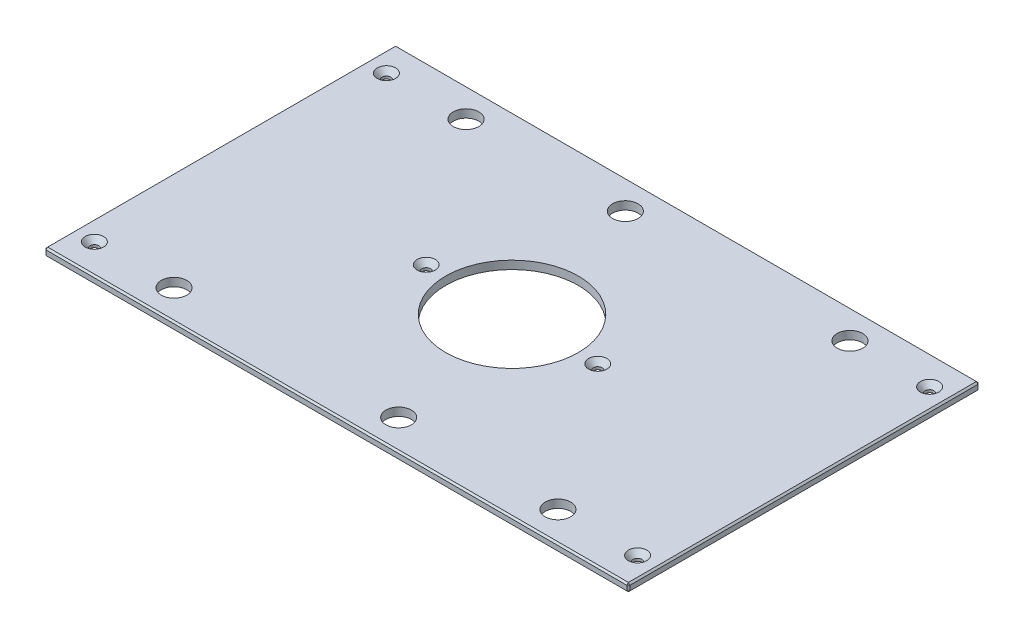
ISO-10303-21;
HEADER;
FILE_DESCRIPTION(('STEP AP214'),'2;1');
FILE_NAME('part.step','',(''),(''),'','','');
FILE_SCHEMA(('AUTOMOTIVE_DESIGN { 1 0 10303 214 1 1 1 1 }'));
ENDSEC;
DATA;
#1=APPLICATION_CONTEXT('core data for automotive mechanical design processes');
#2=APPLICATION_PROTOCOL_DEFINITION('international standard','automotive_design',2000,#1);
#3=PRODUCT_CONTEXT('',#1,'mechanical');
#4=PRODUCT('Part','Part','',(#3));
#5=PRODUCT_RELATED_PRODUCT_CATEGORY('part','',(#4));
#6=PRODUCT_DEFINITION_FORMATION('','',#4);
#7=PRODUCT_DEFINITION_CONTEXT('part definition',#1,'design');
#8=PRODUCT_DEFINITION('design','',#6,#7);
#9=PRODUCT_DEFINITION_SHAPE('','',#8);
#10=(LENGTH_UNIT() NAMED_UNIT(*) SI_UNIT(.MILLI.,.METRE.));
#11=(NAMED_UNIT(*) PLANE_ANGLE_UNIT() SI_UNIT($,.RADIAN.));
#12=(NAMED_UNIT(*) SI_UNIT($,.STERADIAN.) SOLID_ANGLE_UNIT());
#13=UNCERTAINTY_MEASURE_WITH_UNIT(LENGTH_MEASURE(1.E-05),#10,'distance_accuracy_value','');
#14=(GEOMETRIC_REPRESENTATION_CONTEXT(3) GLOBAL_UNCERTAINTY_ASSIGNED_CONTEXT((#13)) GLOBAL_UNIT_ASSIGNED_CONTEXT((#10,
#11,#12)) REPRESENTATION_CONTEXT('',''));
#15=CARTESIAN_POINT('',(0.,0.,0.));
#16=DIRECTION('',(0.,0.,1.));
#17=DIRECTION('',(1.,0.,0.));
#18=AXIS2_PLACEMENT_3D('',#15,#16,#17);
#19=CARTESIAN_POINT('',(-227.0125,6.35,-136.525));
#20=DIRECTION('',(1.,0.,0.));
#21=DIRECTION('',(0.,0.,-1.));
#22=AXIS2_PLACEMENT_3D('',#19,#20,#21);
#23=PLANE('',#22);
#24=DIRECTION('',(0.,0.,-1.));
#25=VECTOR('',#24,1.);
#26=CARTESIAN_POINT('',(-227.0125,5.08000000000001,-136.525));
#27=LINE('',#26,#25);
#28=CARTESIAN_POINT('',(-227.0125,5.08000000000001,135.255));
#29=VERTEX_POINT('',#28);
#30=CARTESIAN_POINT('',(-227.0125,5.08000000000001,-135.255));
#31=VERTEX_POINT('',#30);
#32=EDGE_CURVE('E134',#29,#31,#27,.T.);
#33=ORIENTED_EDGE('',*,*,#32,.T.);
#34=DIRECTION('',(0.,-1.,0.));
#35=VECTOR('',#34,1.);
#36=CARTESIAN_POINT('',(-227.0125,6.35,-135.255));
#37=LINE('',#36,#35);
#38=CARTESIAN_POINT('',(-227.0125,1.26999999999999,-135.255));
#39=VERTEX_POINT('',#38);
#40=EDGE_CURVE('E130',#31,#39,#37,.T.);
#41=ORIENTED_EDGE('',*,*,#40,.T.);
#42=DIRECTION('',(0.,0.,1.));
#43=VECTOR('',#42,1.);
#44=CARTESIAN_POINT('',(-227.0125,1.26999999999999,-136.525));
#45=LINE('',#44,#43);
#46=CARTESIAN_POINT('',(-227.0125,1.26999999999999,135.255));
#47=VERTEX_POINT('',#46);
#48=EDGE_CURVE('E125',#39,#47,#45,.T.);
#49=ORIENTED_EDGE('',*,*,#48,.T.);
#50=DIRECTION('',(0.,1.,0.));
#51=VECTOR('',#50,1.);
#52=CARTESIAN_POINT('',(-227.0125,6.35,135.255));
#53=LINE('',#52,#51);
#54=EDGE_CURVE('E127',#47,#29,#53,.T.);
#55=ORIENTED_EDGE('',*,*,#54,.T.);
#56=EDGE_LOOP('',(#33,#41,#49,#55));
#57=FACE_BOUND('',#56,.T.);
#58=ADVANCED_FACE('F34',(#57),#23,.F.);
#59=CARTESIAN_POINT('',(-227.0125,6.35,136.525));
#60=DIRECTION('',(0.,0.,-1.));
#61=DIRECTION('',(-1.,0.,0.));
#62=AXIS2_PLACEMENT_3D('',#59,#60,#61);
#63=PLANE('',#62);
#64=DIRECTION('',(1.,0.,0.));
#65=VECTOR('',#64,1.);
#66=CARTESIAN_POINT('',(-227.0125,1.26999999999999,136.525));
#67=LINE('',#66,#65);
#68=CARTESIAN_POINT('',(-225.7425,1.26999999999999,136.525));
#69=VERTEX_POINT('',#68);
#70=CARTESIAN_POINT('',(225.7425,1.26999999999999,136.525));
#71=VERTEX_POINT('',#70);
#72=EDGE_CURVE('E57',#69,#71,#67,.T.);
#73=ORIENTED_EDGE('',*,*,#72,.T.);
#74=DIRECTION('',(0.,1.,0.));
#75=VECTOR('',#74,1.);
#76=CARTESIAN_POINT('',(225.7425,6.35,136.525));
#77=LINE('',#76,#75);
#78=CARTESIAN_POINT('',(225.7425,5.08000000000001,136.525));
#79=VERTEX_POINT('',#78);
#80=EDGE_CURVE('E11',#71,#79,#77,.T.);
#81=ORIENTED_EDGE('',*,*,#80,.T.);
#82=DIRECTION('',(-1.,0.,0.));
#83=VECTOR('',#82,1.);
#84=CARTESIAN_POINT('',(-227.0125,5.08000000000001,136.525));
#85=LINE('',#84,#83);
#86=CARTESIAN_POINT('',(-225.7425,5.08000000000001,136.525));
#87=VERTEX_POINT('',#86);
#88=EDGE_CURVE('E43',#79,#87,#85,.T.);
#89=ORIENTED_EDGE('',*,*,#88,.T.);
#90=DIRECTION('',(0.,-1.,0.));
#91=VECTOR('',#90,1.);
#92=CARTESIAN_POINT('',(-225.7425,6.35,136.525));
#93=LINE('',#92,#91);
#94=EDGE_CURVE('E290',#87,#69,#93,.T.);
#95=ORIENTED_EDGE('',*,*,#94,.T.);
#96=EDGE_LOOP('',(#73,#81,#89,#95));
#97=FACE_BOUND('',#96,.T.);
#98=ADVANCED_FACE('F359',(#97),#63,.F.);
#99=CARTESIAN_POINT('',(227.0125,6.35,-136.525));
#100=DIRECTION('',(-1.,0.,0.));
#101=DIRECTION('',(0.,0.,1.));
#102=AXIS2_PLACEMENT_3D('',#99,#100,#101);
#103=PLANE('',#102);
#104=DIRECTION('',(0.,0.,-1.));
#105=VECTOR('',#104,1.);
#106=CARTESIAN_POINT('',(227.0125,1.26999999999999,-136.525));
#107=LINE('',#106,#105);
#108=CARTESIAN_POINT('',(227.0125,1.26999999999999,135.255));
#109=VERTEX_POINT('',#108);
#110=CARTESIAN_POINT('',(227.0125,1.26999999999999,-135.255));
#111=VERTEX_POINT('',#110);
#112=EDGE_CURVE('E285',#109,#111,#107,.T.);
#113=ORIENTED_EDGE('',*,*,#112,.T.);
#114=DIRECTION('',(0.,1.,0.));
#115=VECTOR('',#114,1.);
#116=CARTESIAN_POINT('',(227.0125,6.35,-135.255));
#117=LINE('',#116,#115);
#118=CARTESIAN_POINT('',(227.0125,5.08000000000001,-135.255));
#119=VERTEX_POINT('',#118);
#120=EDGE_CURVE('E287',#111,#119,#117,.T.);
#121=ORIENTED_EDGE('',*,*,#120,.T.);
#122=DIRECTION('',(0.,0.,1.));
#123=VECTOR('',#122,1.);
#124=CARTESIAN_POINT('',(227.0125,5.08000000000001,136.525));
#125=LINE('',#124,#123);
#126=CARTESIAN_POINT('',(227.0125,5.08000000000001,135.255));
#127=VERTEX_POINT('',#126);
#128=EDGE_CURVE('E283',#119,#127,#125,.T.);
#129=ORIENTED_EDGE('',*,*,#128,.T.);
#130=DIRECTION('',(0.,-1.,0.));
#131=VECTOR('',#130,1.);
#132=CARTESIAN_POINT('',(227.0125,6.35,135.255));
#133=LINE('',#132,#131);
#134=EDGE_CURVE('E281',#127,#109,#133,.T.);
#135=ORIENTED_EDGE('',*,*,#134,.T.);
#136=EDGE_LOOP('',(#113,#121,#129,#135));
#137=FACE_BOUND('',#136,.T.);
#138=ADVANCED_FACE('F346',(#137),#103,.F.);
#139=CARTESIAN_POINT('',(-227.0125,6.35,-136.525));
#140=DIRECTION('',(0.,0.,1.));
#141=DIRECTION('',(1.,0.,0.));
#142=AXIS2_PLACEMENT_3D('',#139,#140,#141);
#143=PLANE('',#142);
#144=DIRECTION('',(-1.,0.,0.));
#145=VECTOR('',#144,1.);
#146=CARTESIAN_POINT('',(-227.0125,1.26999999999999,-136.525));
#147=LINE('',#146,#145);
#148=CARTESIAN_POINT('',(225.7425,1.26999999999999,-136.525));
#149=VERTEX_POINT('',#148);
#150=CARTESIAN_POINT('',(-225.7425,1.26999999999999,-136.525));
#151=VERTEX_POINT('',#150);
#152=EDGE_CURVE('E257',#149,#151,#147,.T.);
#153=ORIENTED_EDGE('',*,*,#152,.T.);
#154=DIRECTION('',(0.,1.,0.));
#155=VECTOR('',#154,1.);
#156=CARTESIAN_POINT('',(-225.7425,6.35,-136.525));
#157=LINE('',#156,#155);
#158=CARTESIAN_POINT('',(-225.7425,5.08000000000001,-136.525));
#159=VERTEX_POINT('',#158);
#160=EDGE_CURVE('E261',#151,#159,#157,.T.);
#161=ORIENTED_EDGE('',*,*,#160,.T.);
#162=DIRECTION('',(1.,0.,0.));
#163=VECTOR('',#162,1.);
#164=CARTESIAN_POINT('',(227.0125,5.08000000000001,-136.525));
#165=LINE('',#164,#163);
#166=CARTESIAN_POINT('',(225.7425,5.08000000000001,-136.525));
#167=VERTEX_POINT('',#166);
#168=EDGE_CURVE('E259',#159,#167,#165,.T.);
#169=ORIENTED_EDGE('',*,*,#168,.T.);
#170=DIRECTION('',(0.,-1.,0.));
#171=VECTOR('',#170,1.);
#172=CARTESIAN_POINT('',(225.7425,6.35,-136.525));
#173=LINE('',#172,#171);
#174=EDGE_CURVE('E255',#167,#149,#173,.T.);
#175=ORIENTED_EDGE('',*,*,#174,.T.);
#176=EDGE_LOOP('',(#153,#161,#169,#175));
#177=FACE_BOUND('',#176,.T.);
#178=ADVANCED_FACE('F320',(#177),#143,.F.);
#179=CARTESIAN_POINT('',(0.,6.35,0.));
#180=DIRECTION('',(0.,1.,0.));
#181=DIRECTION('',(0.,0.,1.));
#182=AXIS2_PLACEMENT_3D('',#179,#180,#181);
#183=PLANE('',#182);
#184=CARTESIAN_POINT('',(211.1375,6.35,-113.50498));
#185=DIRECTION('',(0.,1.,0.));
#186=DIRECTION('',(0.,0.,1.));
#187=AXIS2_PLACEMENT_3D('',#184,#185,#186);
#188=CIRCLE('',#187,7.13739999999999);
#189=CARTESIAN_POINT('',(211.1375,6.35,-106.36758));
#190=VERTEX_POINT('',#189);
#191=EDGE_CURVE('E783',#190,#190,#188,.T.);
#192=ORIENTED_EDGE('',*,*,#191,.F.);
#193=EDGE_LOOP('',(#192));
#194=FACE_BOUND('',#193,.T.);
#195=CARTESIAN_POINT('',(211.1375,6.35,113.50498));
#196=DIRECTION('',(0.,1.,0.));
#197=DIRECTION('',(0.,0.,1.));
#198=AXIS2_PLACEMENT_3D('',#195,#196,#197);
#199=CIRCLE('',#198,7.13739999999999);
#200=CARTESIAN_POINT('',(211.1375,6.35,120.64238));
#201=VERTEX_POINT('',#200);
#202=EDGE_CURVE('E787',#201,#201,#199,.T.);
#203=ORIENTED_EDGE('',*,*,#202,.F.);
#204=EDGE_LOOP('',(#203));
#205=FACE_BOUND('',#204,.T.);
#206=CARTESIAN_POINT('',(-211.1375,6.35,113.50498));
#207=DIRECTION('',(0.,1.,0.));
#208=DIRECTION('',(0.,0.,1.));
#209=AXIS2_PLACEMENT_3D('',#206,#207,#208);
#210=CIRCLE('',#209,7.13739999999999);
#211=CARTESIAN_POINT('',(-211.1375,6.35,120.64238));
#212=VERTEX_POINT('',#211);
#213=EDGE_CURVE('E791',#212,#212,#210,.T.);
#214=ORIENTED_EDGE('',*,*,#213,.F.);
#215=EDGE_LOOP('',(#214));
#216=FACE_BOUND('',#215,.T.);
#217=CARTESIAN_POINT('',(-66.675,6.35,0.));
#218=DIRECTION('',(0.,1.,0.));
#219=DIRECTION('',(0.,0.,1.));
#220=AXIS2_PLACEMENT_3D('',#217,#218,#219);
#221=CIRCLE('',#220,7.1374);
#222=CARTESIAN_POINT('',(-66.675,6.35,7.1374));
#223=VERTEX_POINT('',#222);
#224=EDGE_CURVE('E795',#223,#223,#221,.T.);
#225=ORIENTED_EDGE('',*,*,#224,.F.);
#226=EDGE_LOOP('',(#225));
#227=FACE_BOUND('',#226,.T.);
#228=CARTESIAN_POINT('',(66.675,6.35,0.));
#229=DIRECTION('',(0.,1.,0.));
#230=DIRECTION('',(0.,0.,1.));
#231=AXIS2_PLACEMENT_3D('',#228,#229,#230);
#232=CIRCLE('',#231,7.1374);
#233=CARTESIAN_POINT('',(66.675,6.35,7.1374));
#234=VERTEX_POINT('',#233);
#235=EDGE_CURVE('E799',#234,#234,#232,.T.);
#236=ORIENTED_EDGE('',*,*,#235,.F.);
#237=EDGE_LOOP('',(#236));
#238=FACE_BOUND('',#237,.T.);
#239=CARTESIAN_POINT('',(-211.1375,6.35,-113.50498));
#240=DIRECTION('',(0.,1.,0.));
#241=DIRECTION('',(0.,0.,1.));
#242=AXIS2_PLACEMENT_3D('',#239,#240,#241);
#243=CIRCLE('',#242,7.13739999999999);
#244=CARTESIAN_POINT('',(-211.1375,6.35,-106.36758));
#245=VERTEX_POINT('',#244);
#246=EDGE_CURVE('E802',#245,#245,#243,.T.);
#247=ORIENTED_EDGE('',*,*,#246,.F.);
#248=EDGE_LOOP('',(#247));
#249=FACE_BOUND('',#248,.T.);
#250=DIRECTION('',(0.,0.,-1.));
#251=VECTOR('',#250,1.);
#252=CARTESIAN_POINT('',(225.7425,6.35,-136.525));
#253=LINE('',#252,#251);
#254=CARTESIAN_POINT('',(225.7425,6.35,135.255));
#255=VERTEX_POINT('',#254);
#256=CARTESIAN_POINT('',(225.7425,6.35,-135.255));
#257=VERTEX_POINT('',#256);
#258=EDGE_CURVE('E268',#255,#257,#253,.T.);
#259=ORIENTED_EDGE('',*,*,#258,.T.);
#260=DIRECTION('',(-1.,0.,0.));
#261=VECTOR('',#260,1.);
#262=CARTESIAN_POINT('',(-227.0125,6.35,-135.255));
#263=LINE('',#262,#261);
#264=CARTESIAN_POINT('',(-225.7425,6.35,-135.255));
#265=VERTEX_POINT('',#264);
#266=EDGE_CURVE('E270',#257,#265,#263,.T.);
#267=ORIENTED_EDGE('',*,*,#266,.T.);
#268=DIRECTION('',(0.,0.,1.));
#269=VECTOR('',#268,1.);
#270=CARTESIAN_POINT('',(-225.7425,6.35,136.525));
#271=LINE('',#270,#269);
#272=CARTESIAN_POINT('',(-225.7425,6.35,135.255));
#273=VERTEX_POINT('',#272);
#274=EDGE_CURVE('E266',#265,#273,#271,.T.);
#275=ORIENTED_EDGE('',*,*,#274,.T.);
#276=DIRECTION('',(1.,0.,0.));
#277=VECTOR('',#276,1.);
#278=CARTESIAN_POINT('',(227.0125,6.35,135.255));
#279=LINE('',#278,#277);
#280=EDGE_CURVE('E264',#273,#255,#279,.T.);
#281=ORIENTED_EDGE('',*,*,#280,.T.);
#282=EDGE_LOOP('',(#259,#267,#275,#281));
#283=FACE_BOUND('',#282,.T.);
#284=CARTESIAN_POINT('',(149.225,6.35,-113.50498));
#285=DIRECTION('',(0.,1.,0.));
#286=DIRECTION('',(0.,0.,1.));
#287=AXIS2_PLACEMENT_3D('',#284,#285,#286);
#288=CIRCLE('',#287,9.921875);
#289=CARTESIAN_POINT('',(149.225,6.35,-103.583105));
#290=VERTEX_POINT('',#289);
#291=EDGE_CURVE('E203',#290,#290,#288,.T.);
#292=ORIENTED_EDGE('',*,*,#291,.F.);
#293=EDGE_LOOP('',(#292));
#294=FACE_BOUND('',#293,.T.);
#295=CARTESIAN_POINT('',(-149.225,6.35,-113.50498));
#296=DIRECTION('',(0.,1.,0.));
#297=DIRECTION('',(0.,0.,1.));
#298=AXIS2_PLACEMENT_3D('',#295,#296,#297);
#299=CIRCLE('',#298,9.921875);
#300=CARTESIAN_POINT('',(-149.225,6.35,-103.583105));
#301=VERTEX_POINT('',#300);
#302=EDGE_CURVE('E213',#301,#301,#299,.T.);
#303=ORIENTED_EDGE('',*,*,#302,.F.);
#304=EDGE_LOOP('',(#303));
#305=FACE_BOUND('',#304,.T.);
#306=CARTESIAN_POINT('',(149.225,6.35,113.50498));
#307=DIRECTION('',(0.,1.,0.));
#308=DIRECTION('',(0.,0.,1.));
#309=AXIS2_PLACEMENT_3D('',#306,#307,#308);
#310=CIRCLE('',#309,9.921875);
#311=CARTESIAN_POINT('',(149.225,6.35,123.426855));
#312=VERTEX_POINT('',#311);
#313=EDGE_CURVE('E224',#312,#312,#310,.T.);
#314=ORIENTED_EDGE('',*,*,#313,.F.);
#315=EDGE_LOOP('',(#314));
#316=FACE_BOUND('',#315,.T.);
#317=CARTESIAN_POINT('',(-149.225,6.35,113.50498));
#318=DIRECTION('',(0.,1.,0.));
#319=DIRECTION('',(0.,0.,1.));
#320=AXIS2_PLACEMENT_3D('',#317,#318,#319);
#321=CIRCLE('',#320,9.921875);
#322=CARTESIAN_POINT('',(-149.225,6.35,123.426855));
#323=VERTEX_POINT('',#322);
#324=EDGE_CURVE('E230',#323,#323,#321,.T.);
#325=ORIENTED_EDGE('',*,*,#324,.F.);
#326=EDGE_LOOP('',(#325));
#327=FACE_BOUND('',#326,.T.);
#328=CARTESIAN_POINT('',(-25.4,6.35,-113.50498));
#329=DIRECTION('',(0.,1.,0.));
#330=DIRECTION('',(0.,0.,1.));
#331=AXIS2_PLACEMENT_3D('',#328,#329,#330);
#332=CIRCLE('',#331,9.921875);
#333=CARTESIAN_POINT('',(-25.4,6.35,-103.583105));
#334=VERTEX_POINT('',#333);
#335=EDGE_CURVE('E236',#334,#334,#332,.T.);
#336=ORIENTED_EDGE('',*,*,#335,.F.);
#337=EDGE_LOOP('',(#336));
#338=FACE_BOUND('',#337,.T.);
#339=CARTESIAN_POINT('',(25.4,6.35,113.50498));
#340=DIRECTION('',(0.,1.,0.));
#341=DIRECTION('',(0.,0.,1.));
#342=AXIS2_PLACEMENT_3D('',#339,#340,#341);
#343=CIRCLE('',#342,9.921875);
#344=CARTESIAN_POINT('',(25.4,6.35,123.426855));
#345=VERTEX_POINT('',#344);
#346=EDGE_CURVE('E242',#345,#345,#343,.T.);
#347=ORIENTED_EDGE('',*,*,#346,.F.);
#348=EDGE_LOOP('',(#347));
#349=FACE_BOUND('',#348,.T.);
#350=CARTESIAN_POINT('',(0.,6.35,0.));
#351=DIRECTION('',(0.,1.,0.));
#352=DIRECTION('',(0.,0.,1.));
#353=AXIS2_PLACEMENT_3D('',#350,#351,#352);
#354=CIRCLE('',#353,51.562);
#355=CARTESIAN_POINT('',(0.,6.35,51.562));
#356=VERTEX_POINT('',#355);
#357=EDGE_CURVE('E248',#356,#356,#354,.T.);
#358=ORIENTED_EDGE('',*,*,#357,.F.);
#359=EDGE_LOOP('',(#358));
#360=FACE_BOUND('',#359,.T.);
#361=ADVANCED_FACE('F368',(#194,#205,#216,#227,#238,#249,#283,#294,#305,#316,#327,#338,#349,
#360),#183,.T.);
#362=CARTESIAN_POINT('',(0.,0.,0.));
#363=DIRECTION('',(0.,1.,0.));
#364=DIRECTION('',(0.,0.,1.));
#365=AXIS2_PLACEMENT_3D('',#362,#363,#364);
#366=PLANE('',#365);
#367=CARTESIAN_POINT('',(211.1375,0.,-113.50498));
#368=DIRECTION('',(0.,1.,0.));
#369=DIRECTION('',(0.,0.,1.));
#370=AXIS2_PLACEMENT_3D('',#367,#368,#369);
#371=CIRCLE('',#370,3.3782);
#372=CARTESIAN_POINT('',(211.1375,0.,-110.12678));
#373=VERTEX_POINT('',#372);
#374=EDGE_CURVE('E836',#373,#373,#371,.T.);
#375=ORIENTED_EDGE('',*,*,#374,.T.);
#376=EDGE_LOOP('',(#375));
#377=FACE_BOUND('',#376,.T.);
#378=CARTESIAN_POINT('',(211.1375,0.,113.50498));
#379=DIRECTION('',(0.,1.,0.));
#380=DIRECTION('',(0.,0.,1.));
#381=AXIS2_PLACEMENT_3D('',#378,#379,#380);
#382=CIRCLE('',#381,3.3782);
#383=CARTESIAN_POINT('',(211.1375,0.,116.88318));
#384=VERTEX_POINT('',#383);
#385=EDGE_CURVE('E829',#384,#384,#382,.T.);
#386=ORIENTED_EDGE('',*,*,#385,.T.);
#387=EDGE_LOOP('',(#386));
#388=FACE_BOUND('',#387,.T.);
#389=CARTESIAN_POINT('',(-211.1375,0.,113.50498));
#390=DIRECTION('',(0.,1.,0.));
#391=DIRECTION('',(0.,0.,1.));
#392=AXIS2_PLACEMENT_3D('',#389,#390,#391);
#393=CIRCLE('',#392,3.3782);
#394=CARTESIAN_POINT('',(-211.1375,0.,116.88318));
#395=VERTEX_POINT('',#394);
#396=EDGE_CURVE('E822',#395,#395,#393,.T.);
#397=ORIENTED_EDGE('',*,*,#396,.T.);
#398=EDGE_LOOP('',(#397));
#399=FACE_BOUND('',#398,.T.);
#400=CARTESIAN_POINT('',(-66.675,0.,0.));
#401=DIRECTION('',(0.,1.,0.));
#402=DIRECTION('',(0.,0.,1.));
#403=AXIS2_PLACEMENT_3D('',#400,#401,#402);
#404=CIRCLE('',#403,3.3782);
#405=CARTESIAN_POINT('',(-66.675,0.,3.3782));
#406=VERTEX_POINT('',#405);
#407=EDGE_CURVE('E815',#406,#406,#404,.T.);
#408=ORIENTED_EDGE('',*,*,#407,.T.);
#409=EDGE_LOOP('',(#408));
#410=FACE_BOUND('',#409,.T.);
#411=CARTESIAN_POINT('',(66.675,0.,0.));
#412=DIRECTION('',(0.,1.,0.));
#413=DIRECTION('',(0.,0.,1.));
#414=AXIS2_PLACEMENT_3D('',#411,#412,#413);
#415=CIRCLE('',#414,3.3782);
#416=CARTESIAN_POINT('',(66.675,0.,3.3782));
#417=VERTEX_POINT('',#416);
#418=EDGE_CURVE('E805',#417,#417,#415,.T.);
#419=ORIENTED_EDGE('',*,*,#418,.T.);
#420=EDGE_LOOP('',(#419));
#421=FACE_BOUND('',#420,.T.);
#422=CARTESIAN_POINT('',(-211.1375,0.,-113.50498));
#423=DIRECTION('',(0.,1.,0.));
#424=DIRECTION('',(0.,0.,1.));
#425=AXIS2_PLACEMENT_3D('',#422,#423,#424);
#426=CIRCLE('',#425,3.3782);
#427=CARTESIAN_POINT('',(-211.1375,0.,-110.12678));
#428=VERTEX_POINT('',#427);
#429=EDGE_CURVE('E216',#428,#428,#426,.T.);
#430=ORIENTED_EDGE('',*,*,#429,.T.);
#431=EDGE_LOOP('',(#430));
#432=FACE_BOUND('',#431,.T.);
#433=DIRECTION('',(0.,0.,-1.));
#434=VECTOR('',#433,1.);
#435=CARTESIAN_POINT('',(-225.7425,0.,0.));
#436=LINE('',#435,#434);
#437=CARTESIAN_POINT('',(-225.7425,0.,135.255));
#438=VERTEX_POINT('',#437);
#439=CARTESIAN_POINT('',(-225.7425,0.,-135.255));
#440=VERTEX_POINT('',#439);
#441=EDGE_CURVE('E157',#438,#440,#436,.T.);
#442=ORIENTED_EDGE('',*,*,#441,.T.);
#443=DIRECTION('',(1.,0.,0.));
#444=VECTOR('',#443,1.);
#445=CARTESIAN_POINT('',(0.,0.,-135.255));
#446=LINE('',#445,#444);
#447=CARTESIAN_POINT('',(225.7425,0.,-135.255));
#448=VERTEX_POINT('',#447);
#449=EDGE_CURVE('E278',#440,#448,#446,.T.);
#450=ORIENTED_EDGE('',*,*,#449,.T.);
#451=DIRECTION('',(0.,0.,1.));
#452=VECTOR('',#451,1.);
#453=CARTESIAN_POINT('',(225.7425,0.,0.));
#454=LINE('',#453,#452);
#455=CARTESIAN_POINT('',(225.7425,0.,135.255));
#456=VERTEX_POINT('',#455);
#457=EDGE_CURVE('E276',#448,#456,#454,.T.);
#458=ORIENTED_EDGE('',*,*,#457,.T.);
#459=DIRECTION('',(-1.,0.,0.));
#460=VECTOR('',#459,1.);
#461=CARTESIAN_POINT('',(0.,0.,135.255));
#462=LINE('',#461,#460);
#463=EDGE_CURVE('E273',#456,#438,#462,.T.);
#464=ORIENTED_EDGE('',*,*,#463,.T.);
#465=EDGE_LOOP('',(#442,#450,#458,#464));
#466=FACE_BOUND('',#465,.T.);
#467=CARTESIAN_POINT('',(149.225,0.,-113.50498));
#468=DIRECTION('',(0.,1.,0.));
#469=DIRECTION('',(0.,0.,1.));
#470=AXIS2_PLACEMENT_3D('',#467,#468,#469);
#471=CIRCLE('',#470,9.921875);
#472=CARTESIAN_POINT('',(149.225,0.,-103.583105));
#473=VERTEX_POINT('',#472);
#474=EDGE_CURVE('E208',#473,#473,#471,.T.);
#475=ORIENTED_EDGE('',*,*,#474,.T.);
#476=EDGE_LOOP('',(#475));
#477=FACE_BOUND('',#476,.T.);
#478=CARTESIAN_POINT('',(-149.225,0.,-113.50498));
#479=DIRECTION('',(0.,1.,0.));
#480=DIRECTION('',(0.,0.,1.));
#481=AXIS2_PLACEMENT_3D('',#478,#479,#480);
#482=CIRCLE('',#481,9.921875);
#483=CARTESIAN_POINT('',(-149.225,0.,-103.583105));
#484=VERTEX_POINT('',#483);
#485=EDGE_CURVE('E221',#484,#484,#482,.T.);
#486=ORIENTED_EDGE('',*,*,#485,.T.);
#487=EDGE_LOOP('',(#486));
#488=FACE_BOUND('',#487,.T.);
#489=CARTESIAN_POINT('',(149.225,0.,113.50498));
#490=DIRECTION('',(0.,1.,0.));
#491=DIRECTION('',(0.,0.,1.));
#492=AXIS2_PLACEMENT_3D('',#489,#490,#491);
#493=CIRCLE('',#492,9.921875);
#494=CARTESIAN_POINT('',(149.225,0.,123.426855));
#495=VERTEX_POINT('',#494);
#496=EDGE_CURVE('E227',#495,#495,#493,.T.);
#497=ORIENTED_EDGE('',*,*,#496,.T.);
#498=EDGE_LOOP('',(#497));
#499=FACE_BOUND('',#498,.T.);
#500=CARTESIAN_POINT('',(-149.225,0.,113.50498));
#501=DIRECTION('',(0.,1.,0.));
#502=DIRECTION('',(0.,0.,1.));
#503=AXIS2_PLACEMENT_3D('',#500,#501,#502);
#504=CIRCLE('',#503,9.921875);
#505=CARTESIAN_POINT('',(-149.225,0.,123.426855));
#506=VERTEX_POINT('',#505);
#507=EDGE_CURVE('E233',#506,#506,#504,.T.);
#508=ORIENTED_EDGE('',*,*,#507,.T.);
#509=EDGE_LOOP('',(#508));
#510=FACE_BOUND('',#509,.T.);
#511=CARTESIAN_POINT('',(-25.4,0.,-113.50498));
#512=DIRECTION('',(0.,1.,0.));
#513=DIRECTION('',(0.,0.,1.));
#514=AXIS2_PLACEMENT_3D('',#511,#512,#513);
#515=CIRCLE('',#514,9.921875);
#516=CARTESIAN_POINT('',(-25.4,0.,-103.583105));
#517=VERTEX_POINT('',#516);
#518=EDGE_CURVE('E239',#517,#517,#515,.T.);
#519=ORIENTED_EDGE('',*,*,#518,.T.);
#520=EDGE_LOOP('',(#519));
#521=FACE_BOUND('',#520,.T.);
#522=CARTESIAN_POINT('',(25.4,0.,113.50498));
#523=DIRECTION('',(0.,1.,0.));
#524=DIRECTION('',(0.,0.,1.));
#525=AXIS2_PLACEMENT_3D('',#522,#523,#524);
#526=CIRCLE('',#525,9.921875);
#527=CARTESIAN_POINT('',(25.4,0.,123.426855));
#528=VERTEX_POINT('',#527);
#529=EDGE_CURVE('E245',#528,#528,#526,.T.);
#530=ORIENTED_EDGE('',*,*,#529,.T.);
#531=EDGE_LOOP('',(#530));
#532=FACE_BOUND('',#531,.T.);
#533=CARTESIAN_POINT('',(0.,0.,0.));
#534=DIRECTION('',(0.,1.,0.));
#535=DIRECTION('',(0.,0.,1.));
#536=AXIS2_PLACEMENT_3D('',#533,#534,#535);
#537=CIRCLE('',#536,51.562);
#538=CARTESIAN_POINT('',(0.,0.,51.562));
#539=VERTEX_POINT('',#538);
#540=EDGE_CURVE('E146',#539,#539,#537,.T.);
#541=ORIENTED_EDGE('',*,*,#540,.T.);
#542=EDGE_LOOP('',(#541));
#543=FACE_BOUND('',#542,.T.);
#544=ADVANCED_FACE('F333',(#377,#388,#399,#410,#421,#432,#466,#477,#488,#499,#510,#521,#532,
#543),#366,.F.);
#545=CARTESIAN_POINT('',(0.,0.,0.));
#546=DIRECTION('',(0.,1.,0.));
#547=DIRECTION('',(0.,0.,1.));
#548=AXIS2_PLACEMENT_3D('',#545,#546,#547);
#549=CYLINDRICAL_SURFACE('',#548,51.562);
#550=ORIENTED_EDGE('',*,*,#540,.F.);
#551=EDGE_LOOP('',(#550));
#552=FACE_BOUND('',#551,.T.);
#553=ORIENTED_EDGE('',*,*,#357,.T.);
#554=EDGE_LOOP('',(#553));
#555=FACE_BOUND('',#554,.T.);
#556=ADVANCED_FACE('F720',(#552,#555),#549,.F.);
#557=CARTESIAN_POINT('',(25.4,6.35,113.50498));
#558=DIRECTION('',(0.,1.,0.));
#559=DIRECTION('',(0.,0.,1.));
#560=AXIS2_PLACEMENT_3D('',#557,#558,#559);
#561=CYLINDRICAL_SURFACE('',#560,9.921875);
#562=ORIENTED_EDGE('',*,*,#529,.F.);
#563=EDGE_LOOP('',(#562));
#564=FACE_BOUND('',#563,.T.);
#565=ORIENTED_EDGE('',*,*,#346,.T.);
#566=EDGE_LOOP('',(#565));
#567=FACE_BOUND('',#566,.T.);
#568=ADVANCED_FACE('F711',(#564,#567),#561,.F.);
#569=CARTESIAN_POINT('',(-25.4,6.35,-113.50498));
#570=DIRECTION('',(0.,1.,0.));
#571=DIRECTION('',(0.,0.,1.));
#572=AXIS2_PLACEMENT_3D('',#569,#570,#571);
#573=CYLINDRICAL_SURFACE('',#572,9.921875);
#574=ORIENTED_EDGE('',*,*,#518,.F.);
#575=EDGE_LOOP('',(#574));
#576=FACE_BOUND('',#575,.T.);
#577=ORIENTED_EDGE('',*,*,#335,.T.);
#578=EDGE_LOOP('',(#577));
#579=FACE_BOUND('',#578,.T.);
#580=ADVANCED_FACE('F702',(#576,#579),#573,.F.);
#581=CARTESIAN_POINT('',(-149.225,6.35,113.50498));
#582=DIRECTION('',(0.,1.,0.));
#583=DIRECTION('',(0.,0.,1.));
#584=AXIS2_PLACEMENT_3D('',#581,#582,#583);
#585=CYLINDRICAL_SURFACE('',#584,9.921875);
#586=ORIENTED_EDGE('',*,*,#507,.F.);
#587=EDGE_LOOP('',(#586));
#588=FACE_BOUND('',#587,.T.);
#589=ORIENTED_EDGE('',*,*,#324,.T.);
#590=EDGE_LOOP('',(#589));
#591=FACE_BOUND('',#590,.T.);
#592=ADVANCED_FACE('F693',(#588,#591),#585,.F.);
#593=CARTESIAN_POINT('',(149.225,6.35,113.50498));
#594=DIRECTION('',(0.,1.,0.));
#595=DIRECTION('',(0.,0.,1.));
#596=AXIS2_PLACEMENT_3D('',#593,#594,#595);
#597=CYLINDRICAL_SURFACE('',#596,9.921875);
#598=ORIENTED_EDGE('',*,*,#496,.F.);
#599=EDGE_LOOP('',(#598));
#600=FACE_BOUND('',#599,.T.);
#601=ORIENTED_EDGE('',*,*,#313,.T.);
#602=EDGE_LOOP('',(#601));
#603=FACE_BOUND('',#602,.T.);
#604=ADVANCED_FACE('F684',(#600,#603),#597,.F.);
#605=CARTESIAN_POINT('',(-149.225,6.35,-113.50498));
#606=DIRECTION('',(0.,1.,0.));
#607=DIRECTION('',(0.,0.,1.));
#608=AXIS2_PLACEMENT_3D('',#605,#606,#607);
#609=CYLINDRICAL_SURFACE('',#608,9.921875);
#610=ORIENTED_EDGE('',*,*,#485,.F.);
#611=EDGE_LOOP('',(#610));
#612=FACE_BOUND('',#611,.T.);
#613=ORIENTED_EDGE('',*,*,#302,.T.);
#614=EDGE_LOOP('',(#613));
#615=FACE_BOUND('',#614,.T.);
#616=ADVANCED_FACE('F674',(#612,#615),#609,.F.);
#617=CARTESIAN_POINT('',(149.225,6.35,-113.50498));
#618=DIRECTION('',(0.,1.,0.));
#619=DIRECTION('',(0.,0.,1.));
#620=AXIS2_PLACEMENT_3D('',#617,#618,#619);
#621=CYLINDRICAL_SURFACE('',#620,9.921875);
#622=ORIENTED_EDGE('',*,*,#474,.F.);
#623=EDGE_LOOP('',(#622));
#624=FACE_BOUND('',#623,.T.);
#625=ORIENTED_EDGE('',*,*,#291,.T.);
#626=EDGE_LOOP('',(#625));
#627=FACE_BOUND('',#626,.T.);
#628=ADVANCED_FACE('F377',(#624,#627),#621,.F.);
#629=CARTESIAN_POINT('',(227.0125,6.35,135.255));
#630=DIRECTION('',(-0.707106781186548,0.,-0.707106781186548));
#631=DIRECTION('',(0.,-1.,0.));
#632=AXIS2_PLACEMENT_3D('',#629,#630,#631);
#633=PLANE('',#632);
#634=DIRECTION('',(-0.707106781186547,0.,0.707106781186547));
#635=VECTOR('',#634,1.);
#636=CARTESIAN_POINT('',(227.0125,5.08000000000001,135.255));
#637=LINE('',#636,#635);
#638=EDGE_CURVE('E38',#79,#127,#637,.F.);
#639=ORIENTED_EDGE('',*,*,#638,.F.);
#640=ORIENTED_EDGE('',*,*,#80,.F.);
#641=DIRECTION('',(0.707106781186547,0.,-0.707106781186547));
#642=VECTOR('',#641,1.);
#643=CARTESIAN_POINT('',(226.3775,1.26999999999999,135.89));
#644=LINE('',#643,#642);
#645=EDGE_CURVE('E196',#109,#71,#644,.F.);
#646=ORIENTED_EDGE('',*,*,#645,.F.);
#647=ORIENTED_EDGE('',*,*,#134,.F.);
#648=EDGE_LOOP('',(#639,#640,#646,#647));
#649=FACE_BOUND('',#648,.T.);
#650=ADVANCED_FACE('F36',(#649),#633,.F.);
#651=CARTESIAN_POINT('',(227.0125,5.08000000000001,135.255));
#652=DIRECTION('',(0.577350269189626,0.577350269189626,0.577350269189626));
#653=DIRECTION('',(0.707106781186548,0.,-0.707106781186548));
#654=AXIS2_PLACEMENT_3D('',#651,#652,#653);
#655=PLANE('',#654);
#656=DIRECTION('',(0.,-0.707106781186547,0.707106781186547));
#657=VECTOR('',#656,1.);
#658=CARTESIAN_POINT('',(225.7425,5.715,135.89));
#659=LINE('',#658,#657);
#660=EDGE_CURVE('E192',#79,#255,#659,.F.);
#661=ORIENTED_EDGE('',*,*,#660,.F.);
#662=ORIENTED_EDGE('',*,*,#638,.T.);
#663=DIRECTION('',(-0.707106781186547,0.707106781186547,0.));
#664=VECTOR('',#663,1.);
#665=CARTESIAN_POINT('',(227.0125,5.08000000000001,135.255));
#666=LINE('',#665,#664);
#667=EDGE_CURVE('E194',#255,#127,#666,.F.);
#668=ORIENTED_EDGE('',*,*,#667,.F.);
#669=EDGE_LOOP('',(#661,#662,#668));
#670=FACE_BOUND('',#669,.T.);
#671=ADVANCED_FACE('F370',(#670),#655,.T.);
#672=CARTESIAN_POINT('',(225.7425,0.,135.255));
#673=DIRECTION('',(0.577350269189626,-0.577350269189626,0.577350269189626));
#674=DIRECTION('',(0.707106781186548,0.,-0.707106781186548));
#675=AXIS2_PLACEMENT_3D('',#672,#673,#674);
#676=PLANE('',#675);
#677=DIRECTION('',(-0.707106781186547,-0.707106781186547,0.));
#678=VECTOR('',#677,1.);
#679=CARTESIAN_POINT('',(225.7425,0.,135.255));
#680=LINE('',#679,#678);
#681=EDGE_CURVE('E186',#109,#456,#680,.T.);
#682=ORIENTED_EDGE('',*,*,#681,.F.);
#683=ORIENTED_EDGE('',*,*,#645,.T.);
#684=DIRECTION('',(0.,0.707106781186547,0.707106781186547));
#685=VECTOR('',#684,1.);
#686=CARTESIAN_POINT('',(225.7425,0.,135.255));
#687=LINE('',#686,#685);
#688=EDGE_CURVE('E189',#456,#71,#687,.T.);
#689=ORIENTED_EDGE('',*,*,#688,.F.);
#690=EDGE_LOOP('',(#682,#683,#689));
#691=FACE_BOUND('',#690,.T.);
#692=ADVANCED_FACE('F339',(#691),#676,.T.);
#693=CARTESIAN_POINT('',(225.7425,6.35,0.));
#694=DIRECTION('',(0.707106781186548,0.707106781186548,0.));
#695=DIRECTION('',(0.,0.,1.));
#696=AXIS2_PLACEMENT_3D('',#693,#694,#695);
#697=PLANE('',#696);
#698=ORIENTED_EDGE('',*,*,#667,.T.);
#699=ORIENTED_EDGE('',*,*,#128,.F.);
#700=DIRECTION('',(0.707106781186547,-0.707106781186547,0.));
#701=VECTOR('',#700,1.);
#702=CARTESIAN_POINT('',(226.3775,5.715,-135.255));
#703=LINE('',#702,#701);
#704=EDGE_CURVE('E181',#257,#119,#703,.T.);
#705=ORIENTED_EDGE('',*,*,#704,.F.);
#706=ORIENTED_EDGE('',*,*,#258,.F.);
#707=EDGE_LOOP('',(#698,#699,#705,#706));
#708=FACE_BOUND('',#707,.T.);
#709=ADVANCED_FACE('F356',(#708),#697,.T.);
#710=CARTESIAN_POINT('',(0.,6.35,135.255));
#711=DIRECTION('',(0.,0.707106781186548,0.707106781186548));
#712=DIRECTION('',(-1.,0.,0.));
#713=AXIS2_PLACEMENT_3D('',#710,#711,#712);
#714=PLANE('',#713);
#715=ORIENTED_EDGE('',*,*,#660,.T.);
#716=ORIENTED_EDGE('',*,*,#280,.F.);
#717=DIRECTION('',(0.,0.707106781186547,-0.707106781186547));
#718=VECTOR('',#717,1.);
#719=CARTESIAN_POINT('',(-225.7425,6.35,135.255));
#720=LINE('',#719,#718);
#721=EDGE_CURVE('E178',#87,#273,#720,.T.);
#722=ORIENTED_EDGE('',*,*,#721,.F.);
#723=ORIENTED_EDGE('',*,*,#88,.F.);
#724=EDGE_LOOP('',(#715,#716,#722,#723));
#725=FACE_BOUND('',#724,.T.);
#726=ADVANCED_FACE('F361',(#725),#714,.T.);
#727=CARTESIAN_POINT('',(-225.7425,6.35,136.525));
#728=DIRECTION('',(0.707106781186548,0.,-0.707106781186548));
#729=DIRECTION('',(0.,-1.,0.));
#730=AXIS2_PLACEMENT_3D('',#727,#728,#729);
#731=PLANE('',#730);
#732=DIRECTION('',(0.707106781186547,0.,0.707106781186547));
#733=VECTOR('',#732,1.);
#734=CARTESIAN_POINT('',(-227.0125,1.26999999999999,135.255));
#735=LINE('',#734,#733);
#736=EDGE_CURVE('E141',#69,#47,#735,.F.);
#737=ORIENTED_EDGE('',*,*,#736,.F.);
#738=ORIENTED_EDGE('',*,*,#94,.F.);
#739=DIRECTION('',(-0.707106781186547,0.,-0.707106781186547));
#740=VECTOR('',#739,1.);
#741=CARTESIAN_POINT('',(-226.3775,5.08000000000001,135.89));
#742=LINE('',#741,#740);
#743=EDGE_CURVE('E144',#29,#87,#742,.F.);
#744=ORIENTED_EDGE('',*,*,#743,.F.);
#745=ORIENTED_EDGE('',*,*,#54,.F.);
#746=EDGE_LOOP('',(#737,#738,#744,#745));
#747=FACE_BOUND('',#746,.T.);
#748=ADVANCED_FACE('F139',(#747),#731,.F.);
#749=CARTESIAN_POINT('',(-227.0125,1.26999999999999,136.525));
#750=DIRECTION('',(0.,0.707106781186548,-0.707106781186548));
#751=DIRECTION('',(1.,0.,0.));
#752=AXIS2_PLACEMENT_3D('',#749,#750,#751);
#753=PLANE('',#752);
#754=ORIENTED_EDGE('',*,*,#688,.T.);
#755=ORIENTED_EDGE('',*,*,#72,.F.);
#756=DIRECTION('',(0.,-0.707106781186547,-0.707106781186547));
#757=VECTOR('',#756,1.);
#758=CARTESIAN_POINT('',(-225.7425,0.634999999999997,135.89));
#759=LINE('',#758,#757);
#760=EDGE_CURVE('E154',#438,#69,#759,.F.);
#761=ORIENTED_EDGE('',*,*,#760,.F.);
#762=ORIENTED_EDGE('',*,*,#463,.F.);
#763=EDGE_LOOP('',(#754,#755,#761,#762));
#764=FACE_BOUND('',#763,.T.);
#765=ADVANCED_FACE('F338',(#764),#753,.F.);
#766=CARTESIAN_POINT('',(227.0125,1.26999999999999,-136.525));
#767=DIRECTION('',(-0.707106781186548,0.707106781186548,0.));
#768=DIRECTION('',(0.,0.,-1.));
#769=AXIS2_PLACEMENT_3D('',#766,#767,#768);
#770=PLANE('',#769);
#771=ORIENTED_EDGE('',*,*,#681,.T.);
#772=ORIENTED_EDGE('',*,*,#457,.F.);
#773=DIRECTION('',(0.707106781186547,0.707106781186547,0.));
#774=VECTOR('',#773,1.);
#775=CARTESIAN_POINT('',(225.7425,0.,-135.255));
#776=LINE('',#775,#774);
#777=EDGE_CURVE('E173',#111,#448,#776,.F.);
#778=ORIENTED_EDGE('',*,*,#777,.F.);
#779=ORIENTED_EDGE('',*,*,#112,.F.);
#780=EDGE_LOOP('',(#771,#772,#778,#779));
#781=FACE_BOUND('',#780,.T.);
#782=ADVANCED_FACE('F343',(#781),#770,.F.);
#783=CARTESIAN_POINT('',(225.7425,6.35,-136.525));
#784=DIRECTION('',(-0.707106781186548,0.,0.707106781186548));
#785=DIRECTION('',(0.,-1.,0.));
#786=AXIS2_PLACEMENT_3D('',#783,#784,#785);
#787=PLANE('',#786);
#788=DIRECTION('',(0.707106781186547,0.,0.707106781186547));
#789=VECTOR('',#788,1.);
#790=CARTESIAN_POINT('',(225.7425,5.08000000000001,-136.525));
#791=LINE('',#790,#789);
#792=EDGE_CURVE('E183',#119,#167,#791,.F.);
#793=ORIENTED_EDGE('',*,*,#792,.F.);
#794=ORIENTED_EDGE('',*,*,#120,.F.);
#795=DIRECTION('',(-0.707106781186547,0.,-0.707106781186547));
#796=VECTOR('',#795,1.);
#797=CARTESIAN_POINT('',(226.3775,1.26999999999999,-135.89));
#798=LINE('',#797,#796);
#799=EDGE_CURVE('E170',#149,#111,#798,.F.);
#800=ORIENTED_EDGE('',*,*,#799,.F.);
#801=ORIENTED_EDGE('',*,*,#174,.F.);
#802=EDGE_LOOP('',(#793,#794,#800,#801));
#803=FACE_BOUND('',#802,.T.);
#804=ADVANCED_FACE('F351',(#803),#787,.F.);
#805=CARTESIAN_POINT('',(225.7425,5.08000000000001,-136.525));
#806=DIRECTION('',(0.577350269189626,0.577350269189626,-0.577350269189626));
#807=DIRECTION('',(-0.707106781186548,0.,-0.707106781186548));
#808=AXIS2_PLACEMENT_3D('',#805,#806,#807);
#809=PLANE('',#808);
#810=ORIENTED_EDGE('',*,*,#704,.T.);
#811=ORIENTED_EDGE('',*,*,#792,.T.);
#812=DIRECTION('',(0.,0.707106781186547,0.707106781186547));
#813=VECTOR('',#812,1.);
#814=CARTESIAN_POINT('',(225.7425,5.08000000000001,-136.525));
#815=LINE('',#814,#813);
#816=EDGE_CURVE('E162',#257,#167,#815,.F.);
#817=ORIENTED_EDGE('',*,*,#816,.F.);
#818=EDGE_LOOP('',(#810,#811,#817));
#819=FACE_BOUND('',#818,.T.);
#820=ADVANCED_FACE('F409',(#819),#809,.T.);
#821=CARTESIAN_POINT('',(-225.7425,6.35,135.255));
#822=DIRECTION('',(-0.577350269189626,0.577350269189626,0.577350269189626));
#823=DIRECTION('',(0.707106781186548,0.,0.707106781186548));
#824=AXIS2_PLACEMENT_3D('',#821,#822,#823);
#825=PLANE('',#824);
#826=ORIENTED_EDGE('',*,*,#743,.T.);
#827=ORIENTED_EDGE('',*,*,#721,.T.);
#828=DIRECTION('',(-0.707106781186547,-0.707106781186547,0.));
#829=VECTOR('',#828,1.);
#830=CARTESIAN_POINT('',(-225.7425,6.35,135.255));
#831=LINE('',#830,#829);
#832=EDGE_CURVE('E158',#29,#273,#831,.F.);
#833=ORIENTED_EDGE('',*,*,#832,.F.);
#834=EDGE_LOOP('',(#826,#827,#833));
#835=FACE_BOUND('',#834,.T.);
#836=ADVANCED_FACE('F363',(#835),#825,.T.);
#837=CARTESIAN_POINT('',(-227.0125,1.26999999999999,135.255));
#838=DIRECTION('',(-0.577350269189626,-0.577350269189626,0.577350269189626));
#839=DIRECTION('',(0.707106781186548,0.,0.707106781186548));
#840=AXIS2_PLACEMENT_3D('',#837,#838,#839);
#841=PLANE('',#840);
#842=ORIENTED_EDGE('',*,*,#760,.T.);
#843=ORIENTED_EDGE('',*,*,#736,.T.);
#844=DIRECTION('',(-0.707106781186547,0.707106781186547,0.));
#845=VECTOR('',#844,1.);
#846=CARTESIAN_POINT('',(-227.0125,1.26999999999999,135.255));
#847=LINE('',#846,#845);
#848=EDGE_CURVE('E151',#438,#47,#847,.T.);
#849=ORIENTED_EDGE('',*,*,#848,.F.);
#850=EDGE_LOOP('',(#842,#843,#849));
#851=FACE_BOUND('',#850,.T.);
#852=ADVANCED_FACE('F150',(#851),#841,.T.);
#853=CARTESIAN_POINT('',(225.7425,0.,-135.255));
#854=DIRECTION('',(0.577350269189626,-0.577350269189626,-0.577350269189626));
#855=DIRECTION('',(-0.707106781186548,0.,-0.707106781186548));
#856=AXIS2_PLACEMENT_3D('',#853,#854,#855);
#857=PLANE('',#856);
#858=ORIENTED_EDGE('',*,*,#799,.T.);
#859=ORIENTED_EDGE('',*,*,#777,.T.);
#860=DIRECTION('',(0.,-0.707106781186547,0.707106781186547));
#861=VECTOR('',#860,1.);
#862=CARTESIAN_POINT('',(225.7425,0.,-135.255));
#863=LINE('',#862,#861);
#864=EDGE_CURVE('E159',#149,#448,#863,.T.);
#865=ORIENTED_EDGE('',*,*,#864,.F.);
#866=EDGE_LOOP('',(#858,#859,#865));
#867=FACE_BOUND('',#866,.T.);
#868=ADVANCED_FACE('F401',(#867),#857,.T.);
#869=CARTESIAN_POINT('',(0.,6.35,-135.255));
#870=DIRECTION('',(0.,0.707106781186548,-0.707106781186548));
#871=DIRECTION('',(1.,0.,0.));
#872=AXIS2_PLACEMENT_3D('',#869,#870,#871);
#873=PLANE('',#872);
#874=ORIENTED_EDGE('',*,*,#816,.T.);
#875=ORIENTED_EDGE('',*,*,#168,.F.);
#876=DIRECTION('',(0.,-0.707106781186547,-0.707106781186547));
#877=VECTOR('',#876,1.);
#878=CARTESIAN_POINT('',(-225.7425,5.08000000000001,-136.525));
#879=LINE('',#878,#877);
#880=EDGE_CURVE('E164',#265,#159,#879,.T.);
#881=ORIENTED_EDGE('',*,*,#880,.F.);
#882=ORIENTED_EDGE('',*,*,#266,.F.);
#883=EDGE_LOOP('',(#874,#875,#881,#882));
#884=FACE_BOUND('',#883,.T.);
#885=ADVANCED_FACE('F315',(#884),#873,.T.);
#886=CARTESIAN_POINT('',(-225.7425,6.35,0.));
#887=DIRECTION('',(-0.707106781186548,0.707106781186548,0.));
#888=DIRECTION('',(0.,0.,-1.));
#889=AXIS2_PLACEMENT_3D('',#886,#887,#888);
#890=PLANE('',#889);
#891=ORIENTED_EDGE('',*,*,#832,.T.);
#892=ORIENTED_EDGE('',*,*,#274,.F.);
#893=DIRECTION('',(0.707106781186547,0.707106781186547,0.));
#894=VECTOR('',#893,1.);
#895=CARTESIAN_POINT('',(-226.3775,5.715,-135.255));
#896=LINE('',#895,#894);
#897=EDGE_CURVE('E304',#31,#265,#896,.T.);
#898=ORIENTED_EDGE('',*,*,#897,.F.);
#899=ORIENTED_EDGE('',*,*,#32,.F.);
#900=EDGE_LOOP('',(#891,#892,#898,#899));
#901=FACE_BOUND('',#900,.T.);
#902=ADVANCED_FACE('F366',(#901),#890,.T.);
#903=CARTESIAN_POINT('',(-227.0125,1.26999999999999,-136.525));
#904=DIRECTION('',(0.707106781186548,0.707106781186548,0.));
#905=DIRECTION('',(0.,0.,1.));
#906=AXIS2_PLACEMENT_3D('',#903,#904,#905);
#907=PLANE('',#906);
#908=ORIENTED_EDGE('',*,*,#848,.T.);
#909=ORIENTED_EDGE('',*,*,#48,.F.);
#910=DIRECTION('',(0.707106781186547,-0.707106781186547,0.));
#911=VECTOR('',#910,1.);
#912=CARTESIAN_POINT('',(-227.0125,1.26999999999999,-135.255));
#913=LINE('',#912,#911);
#914=EDGE_CURVE('E301',#440,#39,#913,.F.);
#915=ORIENTED_EDGE('',*,*,#914,.F.);
#916=ORIENTED_EDGE('',*,*,#441,.F.);
#917=EDGE_LOOP('',(#908,#909,#915,#916));
#918=FACE_BOUND('',#917,.T.);
#919=ADVANCED_FACE('F156',(#918),#907,.F.);
#920=CARTESIAN_POINT('',(-227.0125,1.26999999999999,-136.525));
#921=DIRECTION('',(0.,0.707106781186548,0.707106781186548));
#922=DIRECTION('',(-1.,0.,0.));
#923=AXIS2_PLACEMENT_3D('',#920,#921,#922);
#924=PLANE('',#923);
#925=ORIENTED_EDGE('',*,*,#864,.T.);
#926=ORIENTED_EDGE('',*,*,#449,.F.);
#927=DIRECTION('',(0.,0.707106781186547,-0.707106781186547));
#928=VECTOR('',#927,1.);
#929=CARTESIAN_POINT('',(-225.7425,0.634999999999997,-135.89));
#930=LINE('',#929,#928);
#931=EDGE_CURVE('E298',#151,#440,#930,.F.);
#932=ORIENTED_EDGE('',*,*,#931,.F.);
#933=ORIENTED_EDGE('',*,*,#152,.F.);
#934=EDGE_LOOP('',(#925,#926,#932,#933));
#935=FACE_BOUND('',#934,.T.);
#936=ADVANCED_FACE('F330',(#935),#924,.F.);
#937=CARTESIAN_POINT('',(-225.7425,5.08000000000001,-136.525));
#938=DIRECTION('',(-0.577350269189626,0.577350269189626,-0.577350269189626));
#939=DIRECTION('',(-0.707106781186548,0.,0.707106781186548));
#940=AXIS2_PLACEMENT_3D('',#937,#938,#939);
#941=PLANE('',#940);
#942=ORIENTED_EDGE('',*,*,#897,.T.);
#943=ORIENTED_EDGE('',*,*,#880,.T.);
#944=DIRECTION('',(0.707106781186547,0.,-0.707106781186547));
#945=VECTOR('',#944,1.);
#946=CARTESIAN_POINT('',(-225.7425,5.08000000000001,-136.525));
#947=LINE('',#946,#945);
#948=EDGE_CURVE('E296',#31,#159,#947,.T.);
#949=ORIENTED_EDGE('',*,*,#948,.F.);
#950=EDGE_LOOP('',(#942,#943,#949));
#951=FACE_BOUND('',#950,.T.);
#952=ADVANCED_FACE('F310',(#951),#941,.T.);
#953=CARTESIAN_POINT('',(-227.0125,1.26999999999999,-135.255));
#954=DIRECTION('',(-0.577350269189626,-0.577350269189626,-0.577350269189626));
#955=DIRECTION('',(-0.707106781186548,0.,0.707106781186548));
#956=AXIS2_PLACEMENT_3D('',#953,#954,#955);
#957=PLANE('',#956);
#958=ORIENTED_EDGE('',*,*,#931,.T.);
#959=ORIENTED_EDGE('',*,*,#914,.T.);
#960=DIRECTION('',(-0.707106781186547,0.,0.707106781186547));
#961=VECTOR('',#960,1.);
#962=CARTESIAN_POINT('',(-227.0125,1.26999999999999,-135.255));
#963=LINE('',#962,#961);
#964=EDGE_CURVE('E294',#151,#39,#963,.T.);
#965=ORIENTED_EDGE('',*,*,#964,.F.);
#966=EDGE_LOOP('',(#958,#959,#965));
#967=FACE_BOUND('',#966,.T.);
#968=ADVANCED_FACE('F327',(#967),#957,.T.);
#969=CARTESIAN_POINT('',(-227.0125,6.35,-135.255));
#970=DIRECTION('',(0.707106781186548,0.,0.707106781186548));
#971=DIRECTION('',(0.,-1.,0.));
#972=AXIS2_PLACEMENT_3D('',#969,#970,#971);
#973=PLANE('',#972);
#974=ORIENTED_EDGE('',*,*,#948,.T.);
#975=ORIENTED_EDGE('',*,*,#160,.F.);
#976=ORIENTED_EDGE('',*,*,#964,.T.);
#977=ORIENTED_EDGE('',*,*,#40,.F.);
#978=EDGE_LOOP('',(#974,#975,#976,#977));
#979=FACE_BOUND('',#978,.T.);
#980=ADVANCED_FACE('F325',(#979),#973,.F.);
#981=CARTESIAN_POINT('',(-211.1375,6.35,-113.50498));
#982=DIRECTION('',(0.,1.,0.));
#983=DIRECTION('',(0.,0.,1.));
#984=AXIS2_PLACEMENT_3D('',#981,#982,#983);
#985=CYLINDRICAL_SURFACE('',#984,3.3782);
#986=ORIENTED_EDGE('',*,*,#429,.F.);
#987=EDGE_LOOP('',(#986));
#988=FACE_BOUND('',#987,.T.);
#989=CARTESIAN_POINT('',(-211.1375,2.02553508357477,-113.50498));
#990=DIRECTION('',(0.,1.,0.));
#991=DIRECTION('',(0.,0.,1.));
#992=AXIS2_PLACEMENT_3D('',#989,#990,#991);
#993=CIRCLE('',#992,3.3782);
#994=CARTESIAN_POINT('',(-211.1375,2.02553508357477,-110.12678));
#995=VERTEX_POINT('',#994);
#996=EDGE_CURVE('E804',#995,#995,#993,.T.);
#997=ORIENTED_EDGE('',*,*,#996,.T.);
#998=EDGE_LOOP('',(#997));
#999=FACE_BOUND('',#998,.T.);
#1000=ADVANCED_FACE('F388',(#988,#999),#985,.F.);
#1001=CARTESIAN_POINT('',(-211.1375,6.35,-113.50498));
#1002=DIRECTION('',(0.,1.,0.));
#1003=DIRECTION('',(0.,0.,1.));
#1004=AXIS2_PLACEMENT_3D('',#1001,#1002,#1003);
#1005=CONICAL_SURFACE('',#1004,7.13739999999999,0.715584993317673);
#1006=ORIENTED_EDGE('',*,*,#996,.F.);
#1007=EDGE_LOOP('',(#1006));
#1008=FACE_BOUND('',#1007,.T.);
#1009=ORIENTED_EDGE('',*,*,#246,.T.);
#1010=EDGE_LOOP('',(#1009));
#1011=FACE_BOUND('',#1010,.T.);
#1012=ADVANCED_FACE('F498',(#1008,#1011),#1005,.F.);
#1013=CARTESIAN_POINT('',(66.675,6.35,0.));
#1014=DIRECTION('',(0.,1.,0.));
#1015=DIRECTION('',(0.,0.,1.));
#1016=AXIS2_PLACEMENT_3D('',#1013,#1014,#1015);
#1017=CYLINDRICAL_SURFACE('',#1016,3.3782);
#1018=ORIENTED_EDGE('',*,*,#418,.F.);
#1019=EDGE_LOOP('',(#1018));
#1020=FACE_BOUND('',#1019,.T.);
#1021=CARTESIAN_POINT('',(66.675,2.02553508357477,0.));
#1022=DIRECTION('',(0.,1.,0.));
#1023=DIRECTION('',(0.,0.,1.));
#1024=AXIS2_PLACEMENT_3D('',#1021,#1022,#1023);
#1025=CIRCLE('',#1024,3.3782);
#1026=CARTESIAN_POINT('',(66.675,2.02553508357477,3.3782));
#1027=VERTEX_POINT('',#1026);
#1028=EDGE_CURVE('E809',#1027,#1027,#1025,.T.);
#1029=ORIENTED_EDGE('',*,*,#1028,.T.);
#1030=EDGE_LOOP('',(#1029));
#1031=FACE_BOUND('',#1030,.T.);
#1032=ADVANCED_FACE('F507',(#1020,#1031),#1017,.F.);
#1033=CARTESIAN_POINT('',(66.675,6.35,0.));
#1034=DIRECTION('',(0.,1.,0.));
#1035=DIRECTION('',(0.,0.,1.));
#1036=AXIS2_PLACEMENT_3D('',#1033,#1034,#1035);
#1037=CONICAL_SURFACE('',#1036,7.1374,0.715584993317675);
#1038=ORIENTED_EDGE('',*,*,#1028,.F.);
#1039=EDGE_LOOP('',(#1038));
#1040=FACE_BOUND('',#1039,.T.);
#1041=ORIENTED_EDGE('',*,*,#235,.T.);
#1042=EDGE_LOOP('',(#1041));
#1043=FACE_BOUND('',#1042,.T.);
#1044=ADVANCED_FACE('F515',(#1040,#1043),#1037,.F.);
#1045=CARTESIAN_POINT('',(-66.675,6.35,0.));
#1046=DIRECTION('',(0.,1.,0.));
#1047=DIRECTION('',(0.,0.,1.));
#1048=AXIS2_PLACEMENT_3D('',#1045,#1046,#1047);
#1049=CYLINDRICAL_SURFACE('',#1048,3.3782);
#1050=ORIENTED_EDGE('',*,*,#407,.F.);
#1051=EDGE_LOOP('',(#1050));
#1052=FACE_BOUND('',#1051,.T.);
#1053=CARTESIAN_POINT('',(-66.675,2.02553508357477,0.));
#1054=DIRECTION('',(0.,1.,0.));
#1055=DIRECTION('',(0.,0.,1.));
#1056=AXIS2_PLACEMENT_3D('',#1053,#1054,#1055);
#1057=CIRCLE('',#1056,3.3782);
#1058=CARTESIAN_POINT('',(-66.675,2.02553508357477,3.3782));
#1059=VERTEX_POINT('',#1058);
#1060=EDGE_CURVE('E818',#1059,#1059,#1057,.T.);
#1061=ORIENTED_EDGE('',*,*,#1060,.T.);
#1062=EDGE_LOOP('',(#1061));
#1063=FACE_BOUND('',#1062,.T.);
#1064=ADVANCED_FACE('F523',(#1052,#1063),#1049,.F.);
#1065=CARTESIAN_POINT('',(-66.675,6.35,0.));
#1066=DIRECTION('',(0.,1.,0.));
#1067=DIRECTION('',(0.,0.,1.));
#1068=AXIS2_PLACEMENT_3D('',#1065,#1066,#1067);
#1069=CONICAL_SURFACE('',#1068,7.1374,0.715584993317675);
#1070=ORIENTED_EDGE('',*,*,#1060,.F.);
#1071=EDGE_LOOP('',(#1070));
#1072=FACE_BOUND('',#1071,.T.);
#1073=ORIENTED_EDGE('',*,*,#224,.T.);
#1074=EDGE_LOOP('',(#1073));
#1075=FACE_BOUND('',#1074,.T.);
#1076=ADVANCED_FACE('F531',(#1072,#1075),#1069,.F.);
#1077=CARTESIAN_POINT('',(-211.1375,6.35,113.50498));
#1078=DIRECTION('',(0.,1.,0.));
#1079=DIRECTION('',(0.,0.,1.));
#1080=AXIS2_PLACEMENT_3D('',#1077,#1078,#1079);
#1081=CYLINDRICAL_SURFACE('',#1080,3.3782);
#1082=ORIENTED_EDGE('',*,*,#396,.F.);
#1083=EDGE_LOOP('',(#1082));
#1084=FACE_BOUND('',#1083,.T.);
#1085=CARTESIAN_POINT('',(-211.1375,2.02553508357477,113.50498));
#1086=DIRECTION('',(0.,1.,0.));
#1087=DIRECTION('',(0.,0.,1.));
#1088=AXIS2_PLACEMENT_3D('',#1085,#1086,#1087);
#1089=CIRCLE('',#1088,3.3782);
#1090=CARTESIAN_POINT('',(-211.1375,2.02553508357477,116.88318));
#1091=VERTEX_POINT('',#1090);
#1092=EDGE_CURVE('E825',#1091,#1091,#1089,.T.);
#1093=ORIENTED_EDGE('',*,*,#1092,.T.);
#1094=EDGE_LOOP('',(#1093));
#1095=FACE_BOUND('',#1094,.T.);
#1096=ADVANCED_FACE('F539',(#1084,#1095),#1081,.F.);
#1097=CARTESIAN_POINT('',(-211.1375,6.35,113.50498));
#1098=DIRECTION('',(0.,1.,0.));
#1099=DIRECTION('',(0.,0.,1.));
#1100=AXIS2_PLACEMENT_3D('',#1097,#1098,#1099);
#1101=CONICAL_SURFACE('',#1100,7.13739999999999,0.715584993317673);
#1102=ORIENTED_EDGE('',*,*,#1092,.F.);
#1103=EDGE_LOOP('',(#1102));
#1104=FACE_BOUND('',#1103,.T.);
#1105=ORIENTED_EDGE('',*,*,#213,.T.);
#1106=EDGE_LOOP('',(#1105));
#1107=FACE_BOUND('',#1106,.T.);
#1108=ADVANCED_FACE('F547',(#1104,#1107),#1101,.F.);
#1109=CARTESIAN_POINT('',(211.1375,6.35,113.50498));
#1110=DIRECTION('',(0.,1.,0.));
#1111=DIRECTION('',(0.,0.,1.));
#1112=AXIS2_PLACEMENT_3D('',#1109,#1110,#1111);
#1113=CYLINDRICAL_SURFACE('',#1112,3.3782);
#1114=ORIENTED_EDGE('',*,*,#385,.F.);
#1115=EDGE_LOOP('',(#1114));
#1116=FACE_BOUND('',#1115,.T.);
#1117=CARTESIAN_POINT('',(211.1375,2.02553508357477,113.50498));
#1118=DIRECTION('',(0.,1.,0.));
#1119=DIRECTION('',(0.,0.,1.));
#1120=AXIS2_PLACEMENT_3D('',#1117,#1118,#1119);
#1121=CIRCLE('',#1120,3.3782);
#1122=CARTESIAN_POINT('',(211.1375,2.02553508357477,116.88318));
#1123=VERTEX_POINT('',#1122);
#1124=EDGE_CURVE('E832',#1123,#1123,#1121,.T.);
#1125=ORIENTED_EDGE('',*,*,#1124,.T.);
#1126=EDGE_LOOP('',(#1125));
#1127=FACE_BOUND('',#1126,.T.);
#1128=ADVANCED_FACE('F555',(#1116,#1127),#1113,.F.);
#1129=CARTESIAN_POINT('',(211.1375,6.35,113.50498));
#1130=DIRECTION('',(0.,1.,0.));
#1131=DIRECTION('',(0.,0.,1.));
#1132=AXIS2_PLACEMENT_3D('',#1129,#1130,#1131);
#1133=CONICAL_SURFACE('',#1132,7.13739999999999,0.715584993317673);
#1134=ORIENTED_EDGE('',*,*,#1124,.F.);
#1135=EDGE_LOOP('',(#1134));
#1136=FACE_BOUND('',#1135,.T.);
#1137=ORIENTED_EDGE('',*,*,#202,.T.);
#1138=EDGE_LOOP('',(#1137));
#1139=FACE_BOUND('',#1138,.T.);
#1140=ADVANCED_FACE('F563',(#1136,#1139),#1133,.F.);
#1141=CARTESIAN_POINT('',(211.1375,6.35,-113.50498));
#1142=DIRECTION('',(0.,1.,0.));
#1143=DIRECTION('',(0.,0.,1.));
#1144=AXIS2_PLACEMENT_3D('',#1141,#1142,#1143);
#1145=CYLINDRICAL_SURFACE('',#1144,3.3782);
#1146=ORIENTED_EDGE('',*,*,#374,.F.);
#1147=EDGE_LOOP('',(#1146));
#1148=FACE_BOUND('',#1147,.T.);
#1149=CARTESIAN_POINT('',(211.1375,2.02553508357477,-113.50498));
#1150=DIRECTION('',(0.,1.,0.));
#1151=DIRECTION('',(0.,0.,1.));
#1152=AXIS2_PLACEMENT_3D('',#1149,#1150,#1151);
#1153=CIRCLE('',#1152,3.3782);
#1154=CARTESIAN_POINT('',(211.1375,2.02553508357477,-110.12678));
#1155=VERTEX_POINT('',#1154);
#1156=EDGE_CURVE('E839',#1155,#1155,#1153,.T.);
#1157=ORIENTED_EDGE('',*,*,#1156,.T.);
#1158=EDGE_LOOP('',(#1157));
#1159=FACE_BOUND('',#1158,.T.);
#1160=ADVANCED_FACE('F571',(#1148,#1159),#1145,.F.);
#1161=CARTESIAN_POINT('',(211.1375,6.35,-113.50498));
#1162=DIRECTION('',(0.,1.,0.));
#1163=DIRECTION('',(0.,0.,1.));
#1164=AXIS2_PLACEMENT_3D('',#1161,#1162,#1163);
#1165=CONICAL_SURFACE('',#1164,7.13739999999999,0.715584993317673);
#1166=ORIENTED_EDGE('',*,*,#1156,.F.);
#1167=EDGE_LOOP('',(#1166));
#1168=FACE_BOUND('',#1167,.T.);
#1169=ORIENTED_EDGE('',*,*,#191,.T.);
#1170=EDGE_LOOP('',(#1169));
#1171=FACE_BOUND('',#1170,.T.);
#1172=ADVANCED_FACE('F579',(#1168,#1171),#1165,.F.);
#1173=CLOSED_SHELL('',(#58,#98,#138,#178,#361,#544,#556,#568,#580,#592,#604,#616,#628,#650,#671,
#692,#709,#726,#748,#765,#782,#804,#820,#836,#852,#868,#885,#902,#919,#936,#952,#968,#980,#1000,
#1012,#1032,#1044,#1064,#1076,#1096,#1108,#1128,#1140,#1160,#1172));
#1174=MANIFOLD_SOLID_BREP('B2',#1173);
#1175=ADVANCED_BREP_SHAPE_REPRESENTATION('',(#18,#1174),#14);
#1176=SHAPE_DEFINITION_REPRESENTATION(#9,#1175);
ENDSEC;
END-ISO-10303-21;
